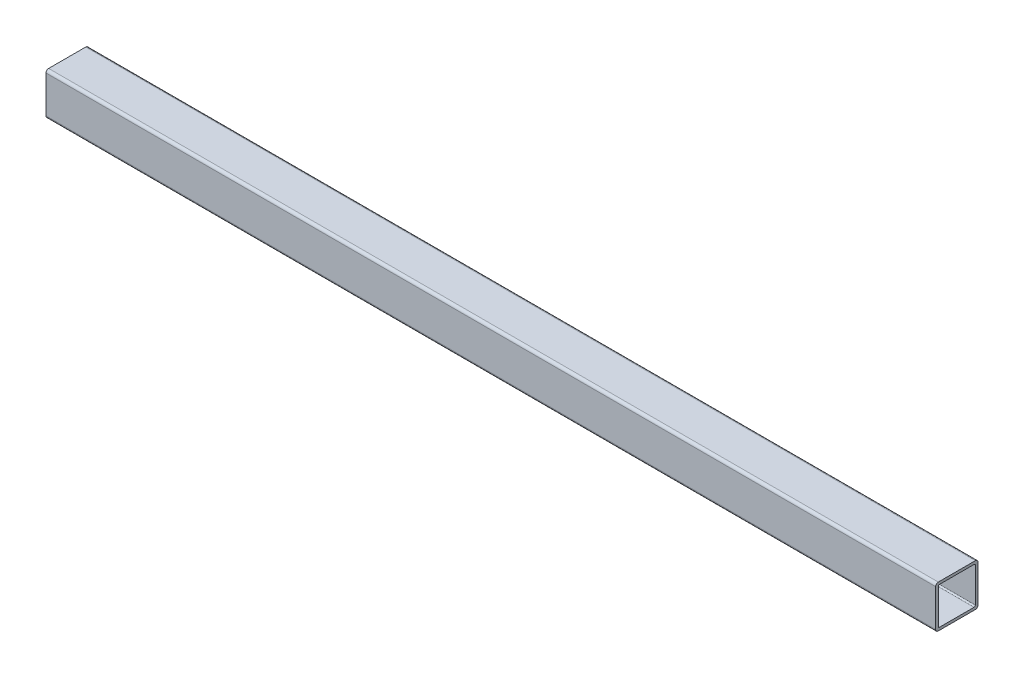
from build123d import *

# Parameters (mm, degrees)
BOSS_EXTRUDE1_DEPTH = 533.4


with BuildPart() as part:
    # Sketch1 → Boss-Extrude1 (new, symmetric)
    with BuildSketch(Plane(origin=(0, 0, 0), x_dir=(0, 0, -1), z_dir=(1, 0, 0))):
        with BuildLine():
            Line((-22.225, 25.4), (22.225, 25.4))
            ThreePointArc((22.225, 25.4), (24.47006403, 24.47006403), (25.4, 22.225))
            Line((25.4, 22.225), (25.4, -22.225))
            ThreePointArc((25.4, -22.225), (24.47006403, -24.47006403), (22.225, -25.4))
            Line((22.225, -25.4), (-22.225, -25.4))
            ThreePointArc((-22.225, -25.4), (-24.47006403, -24.47006403), (-25.4, -22.225))
            Line((-25.4, -22.225), (-25.4, 22.225))
            ThreePointArc((-25.4, 22.225), (-24.47006403, 24.47006403), (-22.225, 25.4))
        make_face()
        with BuildLine():
            Line((-20.6375, 22.225), (20.6375, 22.225))
            ThreePointArc((20.6375, 22.225), (21.760032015, 21.760032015), (22.225, 20.6375))
            Line((22.225, 20.6375), (22.225, -20.6375))
            ThreePointArc((22.225, -20.6375), (21.760032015, -21.760032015), (20.6375, -22.225))
            Line((20.6375, -22.225), (-20.6375, -22.225))
            ThreePointArc((-20.6375, -22.225), (-21.760032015, -21.760032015), (-22.225, -20.6375))
            Line((-22.225, -20.6375), (-22.225, 20.6375))
            ThreePointArc((-22.225, 20.6375), (-21.760032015, 21.760032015), (-20.6375, 22.225))
        make_face(mode=Mode.SUBTRACT)
    extrude(amount=BOSS_EXTRUDE1_DEPTH, both=True)


solid = part.part
